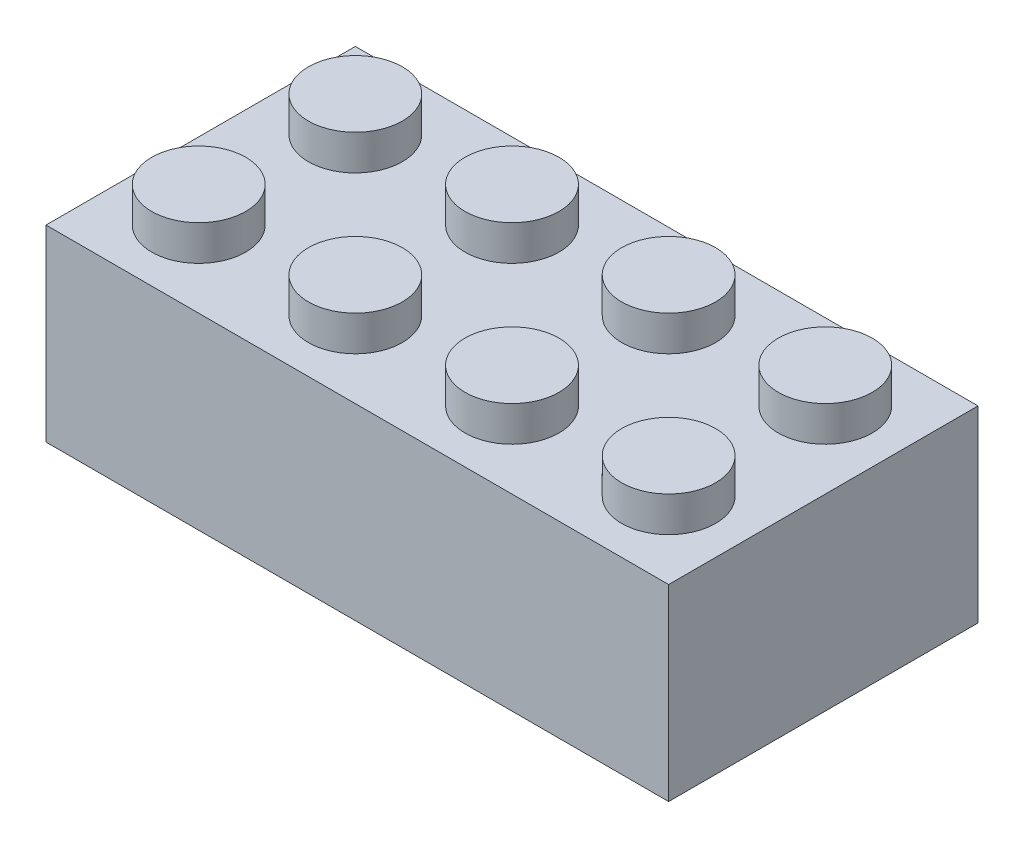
from build123d import *

# Parameters (mm, degrees)
SKIZZE1_W                       = 31.8
SKIZZE1_H                       = 9.6
AUFSATZ_LINEAR_AUSTRAGEN1_DEPTH = 15.8
SKIZZE2_R                       = 2.4
AUFSATZ_LINEAR_AUSTRAGEN2_DEPTH = 1.8


with BuildPart() as part:
    # Skizze1 → Aufsatz-Linear austragen1 (new body)
    with BuildSketch(Plane.XY):
        with Locations((15.9, 4.8)):
            Rectangle(SKIZZE1_W, SKIZZE1_H)
    extrude(amount=AUFSATZ_LINEAR_AUSTRAGEN1_DEPTH)

    # Skizze2 → Aufsatz-Linear austragen2 (add)
    with BuildSketch(Plane(origin=(0, 9.6, 0), x_dir=(1, 0, 0), z_dir=(0, 1, 0))):
        with Locations(Location((3.9, -3.9, 0), (0, 0, 90))):
            Circle(SKIZZE2_R)
        with Locations(Location((11.9, -3.9, 0), (0, 0, 90))):
            Circle(SKIZZE2_R)
        with Locations(Location((11.9, -11.9, 0), (0, 0, 90))):
            Circle(SKIZZE2_R)
        with Locations(Location((3.9, -11.9, 0), (0, 0, 90))):
            Circle(SKIZZE2_R)
        with Locations(Location((19.9, -11.9, 0), (0, 0, 90))):
            Circle(SKIZZE2_R)
        with Locations(Location((27.9, -11.9, 0), (0, 0, 90))):
            Circle(SKIZZE2_R)
        with Locations(Location((19.9, -3.9, 0), (0, 0, 90))):
            Circle(SKIZZE2_R)
        with Locations(Location((27.9, -3.9, 0), (0, 0, 90))):
            Circle(SKIZZE2_R)
    extrude(amount=AUFSATZ_LINEAR_AUSTRAGEN2_DEPTH)


solid = part.part
